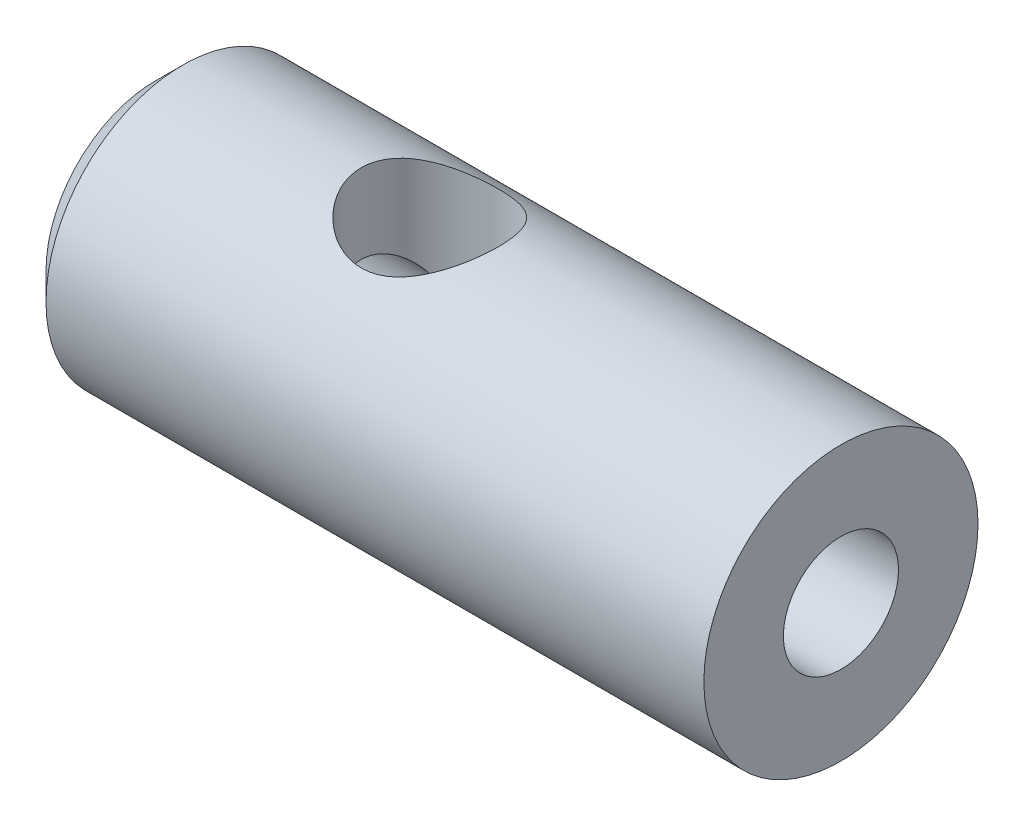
from build123d import *

# Parameters (mm, degrees)
SKETCH1_W         = 25
SKETCH1_H         = 5
M5_TAPPED_HOLE2_D = 4.2
SKETCH6_R         = 2.5
EXTRUDE1_DEPTH    = 28.386127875
CHAMFER1_SIZE     = 1


with BuildPart() as part:
    # Sketch1 → Revolve1 (revolve)
    with BuildSketch(Plane.XY, mode=Mode.PRIVATE) as revolve1_sk:
        with Locations((12.5, 2.5)):
            Rectangle(SKETCH1_W, SKETCH1_H)
    revolve(revolve1_sk.sketch.rotate(Axis((0, 5, 0), (1, 0, 0)), 270), axis=Axis((0, 5, 0), (1, 0, 0)))

    # M5 Tapped Hole2 (through all)
    with Locations(Plane(origin=(25, 5, 0), x_dir=(0, 0, 1), z_dir=(1, 0, 0))):
        with Locations((0, 0)):
            Hole(M5_TAPPED_HOLE2_D / 2)

    # Sketch6 → Extrude1 (cut, through all)
    with BuildSketch(Plane(origin=(0, 0, 0), x_dir=(1, 0, 0), z_dir=(0, 1, 0))):
        with Locations(Location((10, 0, 0), (0, 0, 90))):
            Circle(SKETCH6_R)
    extrude(amount=EXTRUDE1_DEPTH, mode=Mode.SUBTRACT)

    # Chamfer1
    chamfer1_edges = [part.edges().sort_by_distance(p)[0] for p in [
        (0, 5, -5),
    ]]
    chamfer(chamfer1_edges, length=CHAMFER1_SIZE)


solid = part.part
